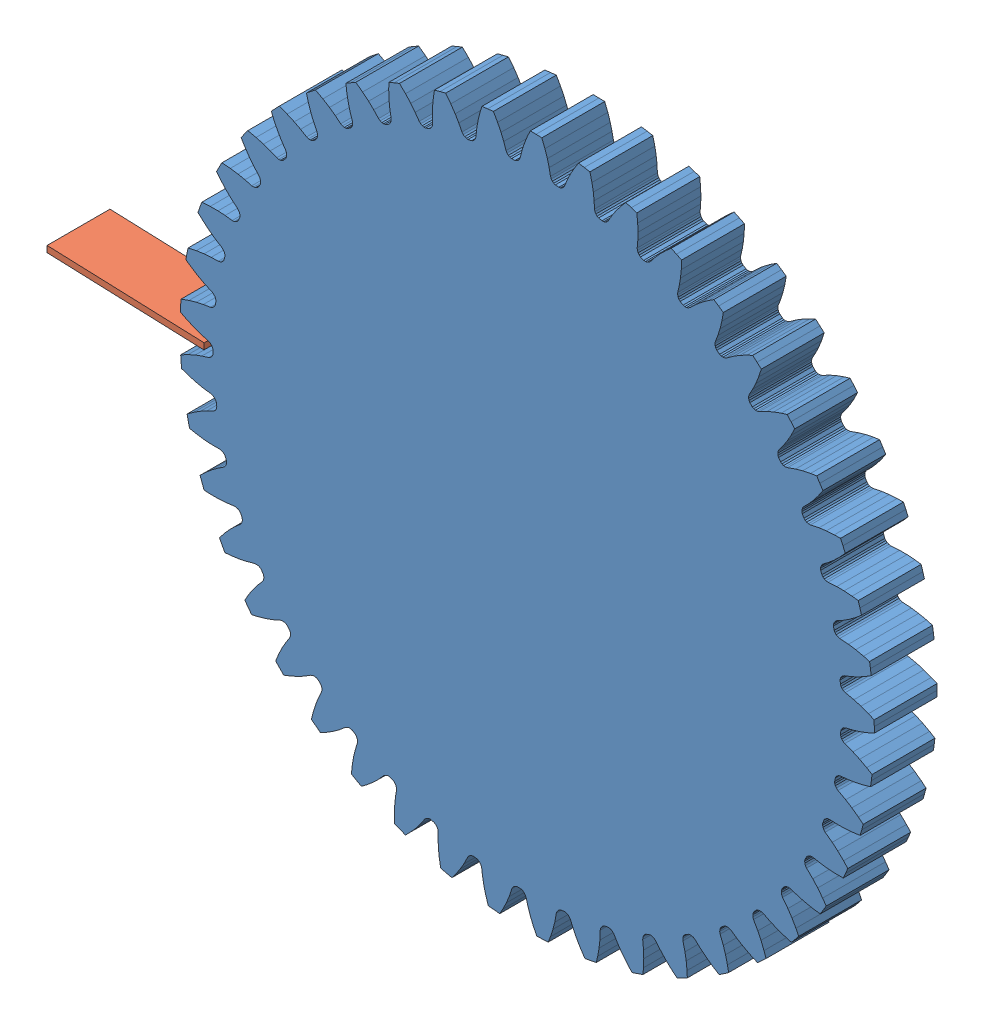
SolidWorks assembly test45 zu 20 evo-test.SLDASM, configuration Standard (file format 3400). Lengths in mm.
Overall size (15.56 15.56 7.56).
2 component instances, 2 part files, 4 mates.
Components (placement in the parent):
- z=45 m=0,235-1: z=45 m=0,235.SLDPRT [Standard] at (16.5911 0 -2.3486) x (0.649841 -0.76007 0) z (0 0 1) size (11.04 11.03 4.59)
- testplatte-1: testplatte.SLDPRT [Standard] at (25.4555 -0.6125 -7.8575) x (0.999312 -0.03709 0) z (0 0 1) size (2.5 0.1 1)
Mates (geometry in assembly coordinates):
- Deckungsgleich35: coincident: point of z=45 m=0,235-1
- Deckungsgleich37: coincident anti-aligned: line of z=45 m=0,235-1
- Deckungsgleich38: coincident aligned: plane of z=45 m=0,235-1 through (14.3377 -5.2134 -2.3486) normal (0 0 -1); plane of testplatte-1 through (8.9573 0.0999 -2.3486) normal (0 0 -1)
- Deckungsgleich39: coincident = 8.683 mm anti-aligned: unknown of testplatte-1
